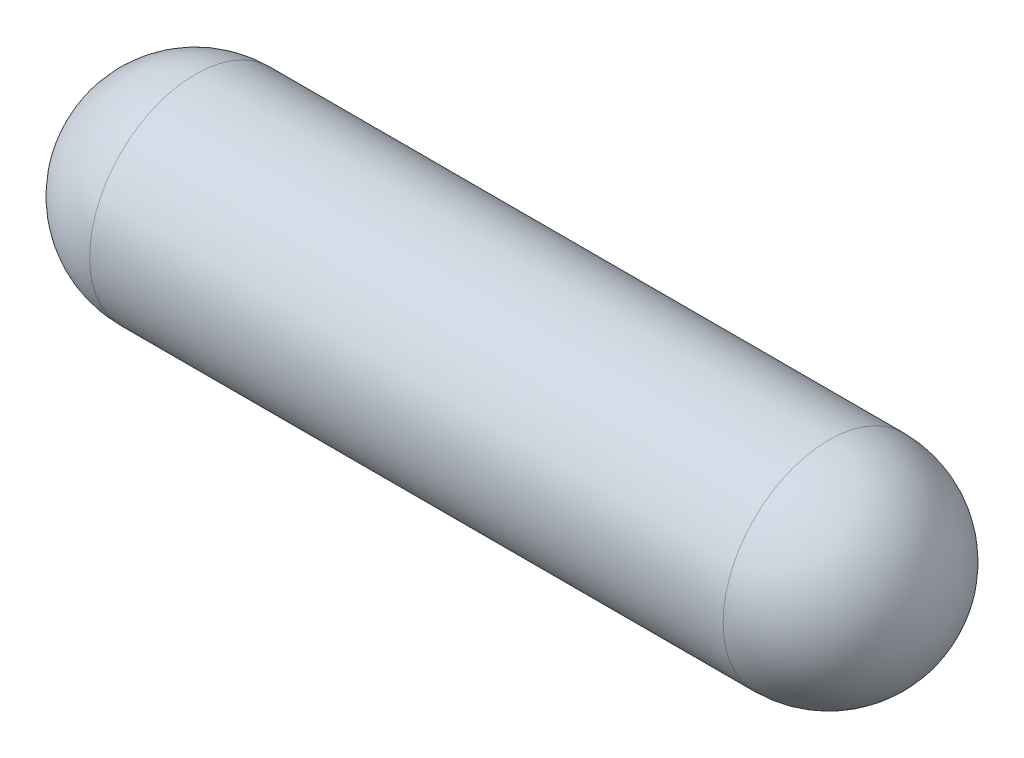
ISO-10303-21;
HEADER;
FILE_DESCRIPTION(('STEP AP214'),'2;1');
FILE_NAME('part.step','',(''),(''),'','','');
FILE_SCHEMA(('AUTOMOTIVE_DESIGN { 1 0 10303 214 1 1 1 1 }'));
ENDSEC;
DATA;
#1=APPLICATION_CONTEXT('core data for automotive mechanical design processes');
#2=APPLICATION_PROTOCOL_DEFINITION('international standard','automotive_design',2000,#1);
#3=PRODUCT_CONTEXT('',#1,'mechanical');
#4=PRODUCT('Part','Part','',(#3));
#5=PRODUCT_RELATED_PRODUCT_CATEGORY('part','',(#4));
#6=PRODUCT_DEFINITION_FORMATION('','',#4);
#7=PRODUCT_DEFINITION_CONTEXT('part definition',#1,'design');
#8=PRODUCT_DEFINITION('design','',#6,#7);
#9=PRODUCT_DEFINITION_SHAPE('','',#8);
#10=(LENGTH_UNIT() NAMED_UNIT(*) SI_UNIT(.MILLI.,.METRE.));
#11=(NAMED_UNIT(*) PLANE_ANGLE_UNIT() SI_UNIT($,.RADIAN.));
#12=(NAMED_UNIT(*) SI_UNIT($,.STERADIAN.) SOLID_ANGLE_UNIT());
#13=UNCERTAINTY_MEASURE_WITH_UNIT(LENGTH_MEASURE(1.E-05),#10,'distance_accuracy_value','');
#14=(GEOMETRIC_REPRESENTATION_CONTEXT(3) GLOBAL_UNCERTAINTY_ASSIGNED_CONTEXT((#13)) GLOBAL_UNIT_ASSIGNED_CONTEXT((#10,
#11,#12)) REPRESENTATION_CONTEXT('',''));
#15=CARTESIAN_POINT('',(0.,0.,0.));
#16=DIRECTION('',(0.,0.,1.));
#17=DIRECTION('',(1.,0.,0.));
#18=AXIS2_PLACEMENT_3D('',#15,#16,#17);
#19=CARTESIAN_POINT('',(-2.25,0.,0.));
#20=DIRECTION('',(-1.,0.,0.));
#21=DIRECTION('',(0.,1.,0.));
#22=AXIS2_PLACEMENT_3D('',#19,#20,#21);
#23=SPHERICAL_SURFACE('',#22,0.75);
#24=CARTESIAN_POINT('',(-2.25,0.,0.));
#25=DIRECTION('',(-1.,0.,0.));
#26=DIRECTION('',(0.,0.,1.));
#27=AXIS2_PLACEMENT_3D('',#24,#25,#26);
#28=CIRCLE('',#27,0.75);
#29=CARTESIAN_POINT('',(-2.25,0.,0.75));
#30=VERTEX_POINT('',#29);
#31=EDGE_CURVE('E354',#30,#30,#28,.T.);
#32=ORIENTED_EDGE('',*,*,#31,.T.);
#33=EDGE_LOOP('',(#32));
#34=FACE_BOUND('',#33,.T.);
#35=ADVANCED_FACE('F348',(#34),#23,.T.);
#36=CARTESIAN_POINT('',(2.25,0.,0.));
#37=DIRECTION('',(-1.,0.,0.));
#38=DIRECTION('',(0.,1.,0.));
#39=AXIS2_PLACEMENT_3D('',#36,#37,#38);
#40=SPHERICAL_SURFACE('',#39,0.75);
#41=CARTESIAN_POINT('',(2.25,0.,0.));
#42=DIRECTION('',(-1.,0.,0.));
#43=DIRECTION('',(0.,0.,1.));
#44=AXIS2_PLACEMENT_3D('',#41,#42,#43);
#45=CIRCLE('',#44,0.75);
#46=CARTESIAN_POINT('',(2.25,0.,0.75));
#47=VERTEX_POINT('',#46);
#48=EDGE_CURVE('E10',#47,#47,#45,.T.);
#49=ORIENTED_EDGE('',*,*,#48,.F.);
#50=EDGE_LOOP('',(#49));
#51=FACE_BOUND('',#50,.T.);
#52=ADVANCED_FACE('F363',(#51),#40,.T.);
#53=CARTESIAN_POINT('',(-4.,0.,0.));
#54=DIRECTION('',(-1.,0.,0.));
#55=DIRECTION('',(0.,0.,1.));
#56=AXIS2_PLACEMENT_3D('',#53,#54,#55);
#57=CYLINDRICAL_SURFACE('',#56,0.75);
#58=ORIENTED_EDGE('',*,*,#31,.F.);
#59=EDGE_LOOP('',(#58));
#60=FACE_BOUND('',#59,.T.);
#61=ORIENTED_EDGE('',*,*,#48,.T.);
#62=EDGE_LOOP('',(#61));
#63=FACE_BOUND('',#62,.T.);
#64=ADVANCED_FACE('F361',(#60,#63),#57,.T.);
#65=CLOSED_SHELL('',(#35,#52,#64));
#66=MANIFOLD_SOLID_BREP('B2',#65);
#67=ADVANCED_BREP_SHAPE_REPRESENTATION('',(#18,#66),#14);
#68=SHAPE_DEFINITION_REPRESENTATION(#9,#67);
ENDSEC;
END-ISO-10303-21;
